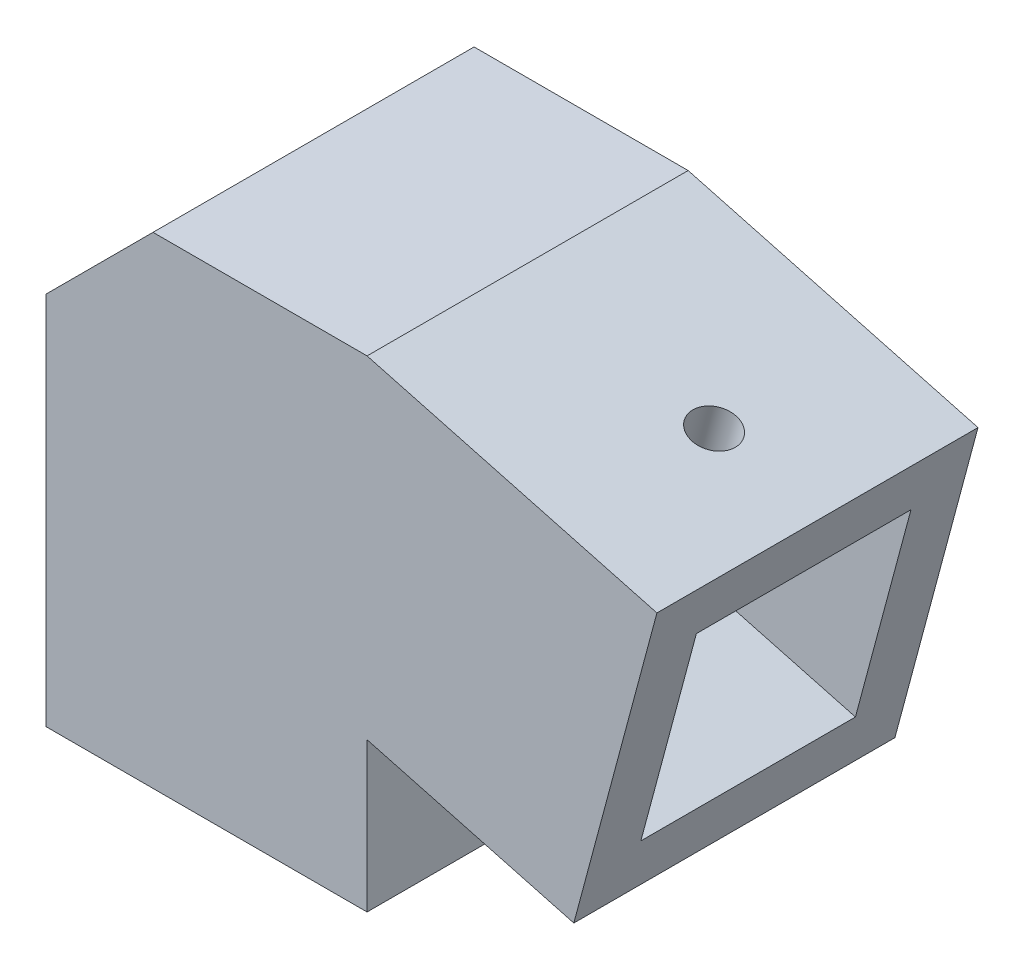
from build123d import *

# Parameters (mm, degrees)
SALIENTE_EXTRUIR1_DEPTH      = 20
SALIENTE_EXTRUIR1_DEPTH_BACK = 25
CROQUIS2_W                   = 30
CROQUIS2_H                   = 30
SALIENTE_EXTRUIR2_DEPTH      = 30
CROQUIS4_W                   = 20.05
CROQUIS4_H                   = 20.05
CORTAR_EXTRUIR1_DEPTH        = 20
CROQUIS5_W                   = 20.05
CROQUIS5_H                   = 20.05
CORTAR_EXTRUIR2_DEPTH        = 22
CHAFL_N1_SIZE                = 10
CROQUIS6_R                   = 2.05
CORTAR_EXTRUIR3_DEPTH        = 4.975
CROQUIS7_R                   = 2.05
CORTAR_EXTRUIR4_DEPTH        = 4.975


with BuildPart() as part:
    # Croquis2 → Saliente-Extruir1 (new, two sides: drawn at the far end of the back side and taken through both)
    with BuildSketch(Plane(origin=(0, 0, 0), x_dir=(1, 0, 0), z_dir=(0, 1, 0)).offset(-SALIENTE_EXTRUIR1_DEPTH_BACK)):
        Rectangle(CROQUIS2_W, CROQUIS2_H)
    extrude(amount=SALIENTE_EXTRUIR1_DEPTH + SALIENTE_EXTRUIR1_DEPTH_BACK)

    # Croquis3 → Saliente-Extruir2 (add)
    with BuildSketch(Plane.XY.offset(15)):
        Polygon((15, 20), (42.083087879, 12.743108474), (34.318516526, -16.234666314), (15, -11.058285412), align=None)
    extrude(amount=-SALIENTE_EXTRUIR2_DEPTH)

    # Croquis4 → Cortar-Extruir1 (cut)
    with BuildSketch(Plane.XZ.offset(25)):
        Rectangle(CROQUIS4_W, CROQUIS4_H)
    extrude(amount=-CORTAR_EXTRUIR1_DEPTH, mode=Mode.SUBTRACT)

    # Croquis5 → Cortar-Extruir2 (cut)
    with BuildSketch(Plane(origin=(36.078278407, -9.667145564, 0), x_dir=(0, 0, -1), z_dir=(0.9659258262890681, -0.25881904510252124, 0))):
        with Locations((0, 8.200802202)):
            Rectangle(CROQUIS5_W, CROQUIS5_H)
    extrude(amount=-CORTAR_EXTRUIR2_DEPTH, mode=Mode.SUBTRACT)

    # Chafl_n1
    chafl_n1_edges = [part.edges().sort_by_distance(p)[0] for p in [
        (-15, 20, 0),
    ]]
    chamfer(chafl_n1_edges, length=CHAFL_N1_SIZE)

    # Croquis6 → Cortar-Extruir3 (cut)
    with BuildSketch(Plane(origin=(6.004809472, 22.410254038, 0), x_dir=(0, 0, -1), z_dir=(0.25881904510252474, 0.9659258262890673, 0))):
        with Locations(Location((0, -27.350982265, 0), (0, 0, 90))):
            Circle(CROQUIS6_R)
    extrude(amount=-CORTAR_EXTRUIR3_DEPTH, mode=Mode.SUBTRACT)

    # Croquis7 → Cortar-Extruir4 (cut)
    with BuildSketch(Plane.ZY.offset(15)):
        with Locations((0, -15)):
            Circle(CROQUIS7_R)
    extrude(amount=-CORTAR_EXTRUIR4_DEPTH, mode=Mode.SUBTRACT)


solid = part.part
